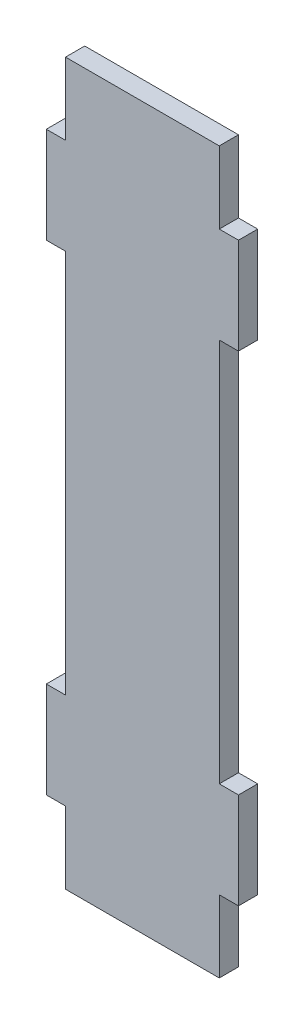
ISO-10303-21;
HEADER;
FILE_DESCRIPTION(('STEP AP214'),'2;1');
FILE_NAME('part.step','',(''),(''),'','','');
FILE_SCHEMA(('AUTOMOTIVE_DESIGN { 1 0 10303 214 1 1 1 1 }'));
ENDSEC;
DATA;
#1=APPLICATION_CONTEXT('core data for automotive mechanical design processes');
#2=APPLICATION_PROTOCOL_DEFINITION('international standard','automotive_design',2000,#1);
#3=PRODUCT_CONTEXT('',#1,'mechanical');
#4=PRODUCT('Part','Part','',(#3));
#5=PRODUCT_RELATED_PRODUCT_CATEGORY('part','',(#4));
#6=PRODUCT_DEFINITION_FORMATION('','',#4);
#7=PRODUCT_DEFINITION_CONTEXT('part definition',#1,'design');
#8=PRODUCT_DEFINITION('design','',#6,#7);
#9=PRODUCT_DEFINITION_SHAPE('','',#8);
#10=(LENGTH_UNIT() NAMED_UNIT(*) SI_UNIT(.MILLI.,.METRE.));
#11=(NAMED_UNIT(*) PLANE_ANGLE_UNIT() SI_UNIT($,.RADIAN.));
#12=(NAMED_UNIT(*) SI_UNIT($,.STERADIAN.) SOLID_ANGLE_UNIT());
#13=UNCERTAINTY_MEASURE_WITH_UNIT(LENGTH_MEASURE(1.E-05),#10,'distance_accuracy_value','');
#14=(GEOMETRIC_REPRESENTATION_CONTEXT(3) GLOBAL_UNCERTAINTY_ASSIGNED_CONTEXT((#13)) GLOBAL_UNIT_ASSIGNED_CONTEXT((#10,
#11,#12)) REPRESENTATION_CONTEXT('',''));
#15=CARTESIAN_POINT('',(0.,0.,0.));
#16=DIRECTION('',(0.,0.,1.));
#17=DIRECTION('',(1.,0.,0.));
#18=AXIS2_PLACEMENT_3D('',#15,#16,#17);
#19=CARTESIAN_POINT('',(-16.,150.,4.));
#20=DIRECTION('',(1.,0.,0.));
#21=DIRECTION('',(0.,1.,0.));
#22=AXIS2_PLACEMENT_3D('',#19,#20,#21);
#23=PLANE('',#22);
#24=DIRECTION('',(0.,-1.,0.));
#25=VECTOR('',#24,1.);
#26=CARTESIAN_POINT('',(-16.,150.,0.));
#27=LINE('',#26,#25);
#28=CARTESIAN_POINT('',(-16.,150.,0.));
#29=VERTEX_POINT('',#28);
#30=CARTESIAN_POINT('',(-16.,135.,0.));
#31=VERTEX_POINT('',#30);
#32=EDGE_CURVE('E201',#29,#31,#27,.T.);
#33=ORIENTED_EDGE('',*,*,#32,.T.);
#34=DIRECTION('',(0.,0.,-1.));
#35=VECTOR('',#34,1.);
#36=CARTESIAN_POINT('',(-16.,135.,4.));
#37=LINE('',#36,#35);
#38=CARTESIAN_POINT('',(-16.,135.,4.));
#39=VERTEX_POINT('',#38);
#40=EDGE_CURVE('E11',#39,#31,#37,.T.);
#41=ORIENTED_EDGE('',*,*,#40,.F.);
#42=DIRECTION('',(0.,-1.,0.));
#43=VECTOR('',#42,1.);
#44=CARTESIAN_POINT('',(-16.,150.,4.));
#45=LINE('',#44,#43);
#46=CARTESIAN_POINT('',(-16.,150.,4.));
#47=VERTEX_POINT('',#46);
#48=EDGE_CURVE('E239',#47,#39,#45,.T.);
#49=ORIENTED_EDGE('',*,*,#48,.F.);
#50=DIRECTION('',(0.,0.,-1.));
#51=VECTOR('',#50,1.);
#52=CARTESIAN_POINT('',(-16.,150.,4.));
#53=LINE('',#52,#51);
#54=EDGE_CURVE('E197',#47,#29,#53,.T.);
#55=ORIENTED_EDGE('',*,*,#54,.T.);
#56=EDGE_LOOP('',(#33,#41,#49,#55));
#57=FACE_BOUND('',#56,.T.);
#58=ADVANCED_FACE('F33',(#57),#23,.F.);
#59=CARTESIAN_POINT('',(-20.,135.,4.));
#60=DIRECTION('',(0.,-1.,0.));
#61=DIRECTION('',(0.,0.,-1.));
#62=AXIS2_PLACEMENT_3D('',#59,#60,#61);
#63=PLANE('',#62);
#64=DIRECTION('',(-1.,0.,0.));
#65=VECTOR('',#64,1.);
#66=CARTESIAN_POINT('',(-20.,135.,0.));
#67=LINE('',#66,#65);
#68=CARTESIAN_POINT('',(-20.,135.,0.));
#69=VERTEX_POINT('',#68);
#70=EDGE_CURVE('E204',#31,#69,#67,.T.);
#71=ORIENTED_EDGE('',*,*,#70,.T.);
#72=DIRECTION('',(0.,0.,-1.));
#73=VECTOR('',#72,1.);
#74=CARTESIAN_POINT('',(-20.,135.,4.));
#75=LINE('',#74,#73);
#76=CARTESIAN_POINT('',(-20.,135.,4.));
#77=VERTEX_POINT('',#76);
#78=EDGE_CURVE('E41',#77,#69,#75,.T.);
#79=ORIENTED_EDGE('',*,*,#78,.F.);
#80=DIRECTION('',(-1.,0.,0.));
#81=VECTOR('',#80,1.);
#82=CARTESIAN_POINT('',(-20.,135.,4.));
#83=LINE('',#82,#81);
#84=EDGE_CURVE('E128',#39,#77,#83,.T.);
#85=ORIENTED_EDGE('',*,*,#84,.F.);
#86=ORIENTED_EDGE('',*,*,#40,.T.);
#87=EDGE_LOOP('',(#71,#79,#85,#86));
#88=FACE_BOUND('',#87,.T.);
#89=ADVANCED_FACE('F357',(#88),#63,.F.);
#90=CARTESIAN_POINT('',(-20.,135.,4.));
#91=DIRECTION('',(1.,0.,0.));
#92=DIRECTION('',(0.,1.,0.));
#93=AXIS2_PLACEMENT_3D('',#90,#91,#92);
#94=PLANE('',#93);
#95=DIRECTION('',(0.,-1.,0.));
#96=VECTOR('',#95,1.);
#97=CARTESIAN_POINT('',(-20.,135.,0.));
#98=LINE('',#97,#96);
#99=CARTESIAN_POINT('',(-20.,115.,0.));
#100=VERTEX_POINT('',#99);
#101=EDGE_CURVE('E206',#69,#100,#98,.T.);
#102=ORIENTED_EDGE('',*,*,#101,.T.);
#103=DIRECTION('',(0.,0.,-1.));
#104=VECTOR('',#103,1.);
#105=CARTESIAN_POINT('',(-20.,115.,4.));
#106=LINE('',#105,#104);
#107=CARTESIAN_POINT('',(-20.,115.,4.));
#108=VERTEX_POINT('',#107);
#109=EDGE_CURVE('E282',#108,#100,#106,.T.);
#110=ORIENTED_EDGE('',*,*,#109,.F.);
#111=DIRECTION('',(0.,-1.,0.));
#112=VECTOR('',#111,1.);
#113=CARTESIAN_POINT('',(-20.,135.,4.));
#114=LINE('',#113,#112);
#115=EDGE_CURVE('E290',#77,#108,#114,.T.);
#116=ORIENTED_EDGE('',*,*,#115,.F.);
#117=ORIENTED_EDGE('',*,*,#78,.T.);
#118=EDGE_LOOP('',(#102,#110,#116,#117));
#119=FACE_BOUND('',#118,.T.);
#120=ADVANCED_FACE('F288',(#119),#94,.F.);
#121=CARTESIAN_POINT('',(-20.,115.,4.));
#122=DIRECTION('',(0.,1.,0.));
#123=DIRECTION('',(0.,0.,1.));
#124=AXIS2_PLACEMENT_3D('',#121,#122,#123);
#125=PLANE('',#124);
#126=DIRECTION('',(1.,0.,0.));
#127=VECTOR('',#126,1.);
#128=CARTESIAN_POINT('',(-20.,115.,0.));
#129=LINE('',#128,#127);
#130=CARTESIAN_POINT('',(-16.,115.,0.));
#131=VERTEX_POINT('',#130);
#132=EDGE_CURVE('E208',#100,#131,#129,.T.);
#133=ORIENTED_EDGE('',*,*,#132,.T.);
#134=DIRECTION('',(0.,0.,-1.));
#135=VECTOR('',#134,1.);
#136=CARTESIAN_POINT('',(-16.,115.,4.));
#137=LINE('',#136,#135);
#138=CARTESIAN_POINT('',(-16.,115.,4.));
#139=VERTEX_POINT('',#138);
#140=EDGE_CURVE('E279',#139,#131,#137,.T.);
#141=ORIENTED_EDGE('',*,*,#140,.F.);
#142=DIRECTION('',(1.,0.,0.));
#143=VECTOR('',#142,1.);
#144=CARTESIAN_POINT('',(-20.,115.,4.));
#145=LINE('',#144,#143);
#146=EDGE_CURVE('E308',#108,#139,#145,.T.);
#147=ORIENTED_EDGE('',*,*,#146,.F.);
#148=ORIENTED_EDGE('',*,*,#109,.T.);
#149=EDGE_LOOP('',(#133,#141,#147,#148));
#150=FACE_BOUND('',#149,.T.);
#151=ADVANCED_FACE('F299',(#150),#125,.F.);
#152=CARTESIAN_POINT('',(-16.,115.,4.));
#153=DIRECTION('',(1.,0.,0.));
#154=DIRECTION('',(0.,1.,0.));
#155=AXIS2_PLACEMENT_3D('',#152,#153,#154);
#156=PLANE('',#155);
#157=DIRECTION('',(0.,-1.,0.));
#158=VECTOR('',#157,1.);
#159=CARTESIAN_POINT('',(-16.,115.,0.));
#160=LINE('',#159,#158);
#161=CARTESIAN_POINT('',(-16.,35.,0.));
#162=VERTEX_POINT('',#161);
#163=EDGE_CURVE('E210',#131,#162,#160,.T.);
#164=ORIENTED_EDGE('',*,*,#163,.T.);
#165=DIRECTION('',(0.,0.,-1.));
#166=VECTOR('',#165,1.);
#167=CARTESIAN_POINT('',(-16.,35.,4.));
#168=LINE('',#167,#166);
#169=CARTESIAN_POINT('',(-16.,35.,4.));
#170=VERTEX_POINT('',#169);
#171=EDGE_CURVE('E276',#170,#162,#168,.T.);
#172=ORIENTED_EDGE('',*,*,#171,.F.);
#173=DIRECTION('',(0.,-1.,0.));
#174=VECTOR('',#173,1.);
#175=CARTESIAN_POINT('',(-16.,115.,4.));
#176=LINE('',#175,#174);
#177=EDGE_CURVE('E305',#139,#170,#176,.T.);
#178=ORIENTED_EDGE('',*,*,#177,.F.);
#179=ORIENTED_EDGE('',*,*,#140,.T.);
#180=EDGE_LOOP('',(#164,#172,#178,#179));
#181=FACE_BOUND('',#180,.T.);
#182=ADVANCED_FACE('F303',(#181),#156,.F.);
#183=CARTESIAN_POINT('',(-20.,35.,4.));
#184=DIRECTION('',(0.,-1.,0.));
#185=DIRECTION('',(0.,0.,-1.));
#186=AXIS2_PLACEMENT_3D('',#183,#184,#185);
#187=PLANE('',#186);
#188=DIRECTION('',(-1.,0.,0.));
#189=VECTOR('',#188,1.);
#190=CARTESIAN_POINT('',(-20.,35.,0.));
#191=LINE('',#190,#189);
#192=CARTESIAN_POINT('',(-20.,35.,0.));
#193=VERTEX_POINT('',#192);
#194=EDGE_CURVE('E212',#162,#193,#191,.T.);
#195=ORIENTED_EDGE('',*,*,#194,.T.);
#196=DIRECTION('',(0.,0.,-1.));
#197=VECTOR('',#196,1.);
#198=CARTESIAN_POINT('',(-20.,35.,4.));
#199=LINE('',#198,#197);
#200=CARTESIAN_POINT('',(-20.,35.,4.));
#201=VERTEX_POINT('',#200);
#202=EDGE_CURVE('E273',#201,#193,#199,.T.);
#203=ORIENTED_EDGE('',*,*,#202,.F.);
#204=DIRECTION('',(-1.,0.,0.));
#205=VECTOR('',#204,1.);
#206=CARTESIAN_POINT('',(-20.,35.,4.));
#207=LINE('',#206,#205);
#208=EDGE_CURVE('E307',#170,#201,#207,.T.);
#209=ORIENTED_EDGE('',*,*,#208,.F.);
#210=ORIENTED_EDGE('',*,*,#171,.T.);
#211=EDGE_LOOP('',(#195,#203,#209,#210));
#212=FACE_BOUND('',#211,.T.);
#213=ADVANCED_FACE('F370',(#212),#187,.F.);
#214=CARTESIAN_POINT('',(-20.,35.,4.));
#215=DIRECTION('',(1.,0.,0.));
#216=DIRECTION('',(0.,1.,0.));
#217=AXIS2_PLACEMENT_3D('',#214,#215,#216);
#218=PLANE('',#217);
#219=DIRECTION('',(0.,-1.,0.));
#220=VECTOR('',#219,1.);
#221=CARTESIAN_POINT('',(-20.,35.,0.));
#222=LINE('',#221,#220);
#223=CARTESIAN_POINT('',(-20.,15.,0.));
#224=VERTEX_POINT('',#223);
#225=EDGE_CURVE('E214',#193,#224,#222,.T.);
#226=ORIENTED_EDGE('',*,*,#225,.T.);
#227=DIRECTION('',(0.,0.,-1.));
#228=VECTOR('',#227,1.);
#229=CARTESIAN_POINT('',(-20.,15.,4.));
#230=LINE('',#229,#228);
#231=CARTESIAN_POINT('',(-20.,15.,4.));
#232=VERTEX_POINT('',#231);
#233=EDGE_CURVE('E270',#232,#224,#230,.T.);
#234=ORIENTED_EDGE('',*,*,#233,.F.);
#235=DIRECTION('',(0.,-1.,0.));
#236=VECTOR('',#235,1.);
#237=CARTESIAN_POINT('',(-20.,35.,4.));
#238=LINE('',#237,#236);
#239=EDGE_CURVE('E310',#201,#232,#238,.T.);
#240=ORIENTED_EDGE('',*,*,#239,.F.);
#241=ORIENTED_EDGE('',*,*,#202,.T.);
#242=EDGE_LOOP('',(#226,#234,#240,#241));
#243=FACE_BOUND('',#242,.T.);
#244=ADVANCED_FACE('F373',(#243),#218,.F.);
#245=CARTESIAN_POINT('',(-20.,15.,4.));
#246=DIRECTION('',(0.,1.,0.));
#247=DIRECTION('',(-1.,0.,0.));
#248=AXIS2_PLACEMENT_3D('',#245,#246,#247);
#249=PLANE('',#248);
#250=DIRECTION('',(1.,0.,0.));
#251=VECTOR('',#250,1.);
#252=CARTESIAN_POINT('',(-20.,15.,0.));
#253=LINE('',#252,#251);
#254=CARTESIAN_POINT('',(-16.,15.,0.));
#255=VERTEX_POINT('',#254);
#256=EDGE_CURVE('E216',#224,#255,#253,.T.);
#257=ORIENTED_EDGE('',*,*,#256,.T.);
#258=DIRECTION('',(0.,0.,-1.));
#259=VECTOR('',#258,1.);
#260=CARTESIAN_POINT('',(-16.,15.,4.));
#261=LINE('',#260,#259);
#262=CARTESIAN_POINT('',(-16.,15.,4.));
#263=VERTEX_POINT('',#262);
#264=EDGE_CURVE('E267',#263,#255,#261,.T.);
#265=ORIENTED_EDGE('',*,*,#264,.F.);
#266=DIRECTION('',(1.,0.,0.));
#267=VECTOR('',#266,1.);
#268=CARTESIAN_POINT('',(-20.,15.,4.));
#269=LINE('',#268,#267);
#270=EDGE_CURVE('E316',#232,#263,#269,.T.);
#271=ORIENTED_EDGE('',*,*,#270,.F.);
#272=ORIENTED_EDGE('',*,*,#233,.T.);
#273=EDGE_LOOP('',(#257,#265,#271,#272));
#274=FACE_BOUND('',#273,.T.);
#275=ADVANCED_FACE('F377',(#274),#249,.F.);
#276=CARTESIAN_POINT('',(-16.,15.,4.));
#277=DIRECTION('',(1.,0.,0.));
#278=DIRECTION('',(0.,1.,0.));
#279=AXIS2_PLACEMENT_3D('',#276,#277,#278);
#280=PLANE('',#279);
#281=DIRECTION('',(0.,-1.,0.));
#282=VECTOR('',#281,1.);
#283=CARTESIAN_POINT('',(-16.,15.,0.));
#284=LINE('',#283,#282);
#285=CARTESIAN_POINT('',(-16.,0.,0.));
#286=VERTEX_POINT('',#285);
#287=EDGE_CURVE('E218',#255,#286,#284,.T.);
#288=ORIENTED_EDGE('',*,*,#287,.T.);
#289=DIRECTION('',(0.,0.,-1.));
#290=VECTOR('',#289,1.);
#291=CARTESIAN_POINT('',(-16.,0.,4.));
#292=LINE('',#291,#290);
#293=CARTESIAN_POINT('',(-16.,0.,4.));
#294=VERTEX_POINT('',#293);
#295=EDGE_CURVE('E264',#294,#286,#292,.T.);
#296=ORIENTED_EDGE('',*,*,#295,.F.);
#297=DIRECTION('',(0.,-1.,0.));
#298=VECTOR('',#297,1.);
#299=CARTESIAN_POINT('',(-16.,15.,4.));
#300=LINE('',#299,#298);
#301=EDGE_CURVE('E318',#263,#294,#300,.T.);
#302=ORIENTED_EDGE('',*,*,#301,.F.);
#303=ORIENTED_EDGE('',*,*,#264,.T.);
#304=EDGE_LOOP('',(#288,#296,#302,#303));
#305=FACE_BOUND('',#304,.T.);
#306=ADVANCED_FACE('F381',(#305),#280,.F.);
#307=CARTESIAN_POINT('',(-16.,0.,4.));
#308=DIRECTION('',(0.,1.,0.));
#309=DIRECTION('',(0.,0.,1.));
#310=AXIS2_PLACEMENT_3D('',#307,#308,#309);
#311=PLANE('',#310);
#312=DIRECTION('',(1.,0.,0.));
#313=VECTOR('',#312,1.);
#314=CARTESIAN_POINT('',(-16.,0.,0.));
#315=LINE('',#314,#313);
#316=CARTESIAN_POINT('',(16.,0.,0.));
#317=VERTEX_POINT('',#316);
#318=EDGE_CURVE('E220',#286,#317,#315,.T.);
#319=ORIENTED_EDGE('',*,*,#318,.T.);
#320=DIRECTION('',(0.,0.,-1.));
#321=VECTOR('',#320,1.);
#322=CARTESIAN_POINT('',(16.,0.,4.));
#323=LINE('',#322,#321);
#324=CARTESIAN_POINT('',(16.,0.,4.));
#325=VERTEX_POINT('',#324);
#326=EDGE_CURVE('E261',#325,#317,#323,.T.);
#327=ORIENTED_EDGE('',*,*,#326,.F.);
#328=DIRECTION('',(1.,0.,0.));
#329=VECTOR('',#328,1.);
#330=CARTESIAN_POINT('',(-16.,0.,4.));
#331=LINE('',#330,#329);
#332=EDGE_CURVE('E320',#294,#325,#331,.T.);
#333=ORIENTED_EDGE('',*,*,#332,.F.);
#334=ORIENTED_EDGE('',*,*,#295,.T.);
#335=EDGE_LOOP('',(#319,#327,#333,#334));
#336=FACE_BOUND('',#335,.T.);
#337=ADVANCED_FACE('F385',(#336),#311,.F.);
#338=CARTESIAN_POINT('',(16.,15.,4.));
#339=DIRECTION('',(-1.,0.,0.));
#340=DIRECTION('',(0.,-1.,0.));
#341=AXIS2_PLACEMENT_3D('',#338,#339,#340);
#342=PLANE('',#341);
#343=DIRECTION('',(0.,1.,0.));
#344=VECTOR('',#343,1.);
#345=CARTESIAN_POINT('',(16.,15.,0.));
#346=LINE('',#345,#344);
#347=CARTESIAN_POINT('',(16.,15.,0.));
#348=VERTEX_POINT('',#347);
#349=EDGE_CURVE('E222',#317,#348,#346,.T.);
#350=ORIENTED_EDGE('',*,*,#349,.T.);
#351=DIRECTION('',(0.,0.,-1.));
#352=VECTOR('',#351,1.);
#353=CARTESIAN_POINT('',(16.,15.,4.));
#354=LINE('',#353,#352);
#355=CARTESIAN_POINT('',(16.,15.,4.));
#356=VERTEX_POINT('',#355);
#357=EDGE_CURVE('E258',#356,#348,#354,.T.);
#358=ORIENTED_EDGE('',*,*,#357,.F.);
#359=DIRECTION('',(0.,1.,0.));
#360=VECTOR('',#359,1.);
#361=CARTESIAN_POINT('',(16.,15.,4.));
#362=LINE('',#361,#360);
#363=EDGE_CURVE('E322',#325,#356,#362,.T.);
#364=ORIENTED_EDGE('',*,*,#363,.F.);
#365=ORIENTED_EDGE('',*,*,#326,.T.);
#366=EDGE_LOOP('',(#350,#358,#364,#365));
#367=FACE_BOUND('',#366,.T.);
#368=ADVANCED_FACE('F389',(#367),#342,.F.);
#369=CARTESIAN_POINT('',(16.,15.,4.));
#370=DIRECTION('',(0.,1.,0.));
#371=DIRECTION('',(-1.,0.,0.));
#372=AXIS2_PLACEMENT_3D('',#369,#370,#371);
#373=PLANE('',#372);
#374=DIRECTION('',(1.,0.,0.));
#375=VECTOR('',#374,1.);
#376=CARTESIAN_POINT('',(16.,15.,0.));
#377=LINE('',#376,#375);
#378=CARTESIAN_POINT('',(20.,15.,0.));
#379=VERTEX_POINT('',#378);
#380=EDGE_CURVE('E224',#348,#379,#377,.T.);
#381=ORIENTED_EDGE('',*,*,#380,.T.);
#382=DIRECTION('',(0.,0.,-1.));
#383=VECTOR('',#382,1.);
#384=CARTESIAN_POINT('',(20.,15.,4.));
#385=LINE('',#384,#383);
#386=CARTESIAN_POINT('',(20.,15.,4.));
#387=VERTEX_POINT('',#386);
#388=EDGE_CURVE('E255',#387,#379,#385,.T.);
#389=ORIENTED_EDGE('',*,*,#388,.F.);
#390=DIRECTION('',(1.,0.,0.));
#391=VECTOR('',#390,1.);
#392=CARTESIAN_POINT('',(16.,15.,4.));
#393=LINE('',#392,#391);
#394=EDGE_CURVE('E324',#356,#387,#393,.T.);
#395=ORIENTED_EDGE('',*,*,#394,.F.);
#396=ORIENTED_EDGE('',*,*,#357,.T.);
#397=EDGE_LOOP('',(#381,#389,#395,#396));
#398=FACE_BOUND('',#397,.T.);
#399=ADVANCED_FACE('F393',(#398),#373,.F.);
#400=CARTESIAN_POINT('',(20.,35.,4.));
#401=DIRECTION('',(-1.,0.,0.));
#402=DIRECTION('',(0.,-1.,0.));
#403=AXIS2_PLACEMENT_3D('',#400,#401,#402);
#404=PLANE('',#403);
#405=DIRECTION('',(0.,1.,0.));
#406=VECTOR('',#405,1.);
#407=CARTESIAN_POINT('',(20.,35.,0.));
#408=LINE('',#407,#406);
#409=CARTESIAN_POINT('',(20.,35.,0.));
#410=VERTEX_POINT('',#409);
#411=EDGE_CURVE('E226',#379,#410,#408,.T.);
#412=ORIENTED_EDGE('',*,*,#411,.T.);
#413=DIRECTION('',(0.,0.,-1.));
#414=VECTOR('',#413,1.);
#415=CARTESIAN_POINT('',(20.,35.,4.));
#416=LINE('',#415,#414);
#417=CARTESIAN_POINT('',(20.,35.,4.));
#418=VERTEX_POINT('',#417);
#419=EDGE_CURVE('E252',#418,#410,#416,.T.);
#420=ORIENTED_EDGE('',*,*,#419,.F.);
#421=DIRECTION('',(0.,1.,0.));
#422=VECTOR('',#421,1.);
#423=CARTESIAN_POINT('',(20.,35.,4.));
#424=LINE('',#423,#422);
#425=EDGE_CURVE('E326',#387,#418,#424,.T.);
#426=ORIENTED_EDGE('',*,*,#425,.F.);
#427=ORIENTED_EDGE('',*,*,#388,.T.);
#428=EDGE_LOOP('',(#412,#420,#426,#427));
#429=FACE_BOUND('',#428,.T.);
#430=ADVANCED_FACE('F397',(#429),#404,.F.);
#431=CARTESIAN_POINT('',(16.,35.,4.));
#432=DIRECTION('',(0.,-1.,0.));
#433=DIRECTION('',(0.,0.,-1.));
#434=AXIS2_PLACEMENT_3D('',#431,#432,#433);
#435=PLANE('',#434);
#436=DIRECTION('',(-1.,0.,0.));
#437=VECTOR('',#436,1.);
#438=CARTESIAN_POINT('',(16.,35.,0.));
#439=LINE('',#438,#437);
#440=CARTESIAN_POINT('',(16.,35.,0.));
#441=VERTEX_POINT('',#440);
#442=EDGE_CURVE('E228',#410,#441,#439,.T.);
#443=ORIENTED_EDGE('',*,*,#442,.T.);
#444=DIRECTION('',(0.,0.,-1.));
#445=VECTOR('',#444,1.);
#446=CARTESIAN_POINT('',(16.,35.,4.));
#447=LINE('',#446,#445);
#448=CARTESIAN_POINT('',(16.,35.,4.));
#449=VERTEX_POINT('',#448);
#450=EDGE_CURVE('E249',#449,#441,#447,.T.);
#451=ORIENTED_EDGE('',*,*,#450,.F.);
#452=DIRECTION('',(-1.,0.,0.));
#453=VECTOR('',#452,1.);
#454=CARTESIAN_POINT('',(16.,35.,4.));
#455=LINE('',#454,#453);
#456=EDGE_CURVE('E328',#418,#449,#455,.T.);
#457=ORIENTED_EDGE('',*,*,#456,.F.);
#458=ORIENTED_EDGE('',*,*,#419,.T.);
#459=EDGE_LOOP('',(#443,#451,#457,#458));
#460=FACE_BOUND('',#459,.T.);
#461=ADVANCED_FACE('F401',(#460),#435,.F.);
#462=CARTESIAN_POINT('',(16.,115.,4.));
#463=DIRECTION('',(-1.,0.,0.));
#464=DIRECTION('',(0.,-1.,0.));
#465=AXIS2_PLACEMENT_3D('',#462,#463,#464);
#466=PLANE('',#465);
#467=DIRECTION('',(0.,1.,0.));
#468=VECTOR('',#467,1.);
#469=CARTESIAN_POINT('',(16.,115.,0.));
#470=LINE('',#469,#468);
#471=CARTESIAN_POINT('',(16.,115.,0.));
#472=VERTEX_POINT('',#471);
#473=EDGE_CURVE('E230',#441,#472,#470,.T.);
#474=ORIENTED_EDGE('',*,*,#473,.T.);
#475=DIRECTION('',(0.,0.,-1.));
#476=VECTOR('',#475,1.);
#477=CARTESIAN_POINT('',(16.,115.,4.));
#478=LINE('',#477,#476);
#479=CARTESIAN_POINT('',(16.,115.,4.));
#480=VERTEX_POINT('',#479);
#481=EDGE_CURVE('E246',#480,#472,#478,.T.);
#482=ORIENTED_EDGE('',*,*,#481,.F.);
#483=DIRECTION('',(0.,1.,0.));
#484=VECTOR('',#483,1.);
#485=CARTESIAN_POINT('',(16.,115.,4.));
#486=LINE('',#485,#484);
#487=EDGE_CURVE('E330',#449,#480,#486,.T.);
#488=ORIENTED_EDGE('',*,*,#487,.F.);
#489=ORIENTED_EDGE('',*,*,#450,.T.);
#490=EDGE_LOOP('',(#474,#482,#488,#489));
#491=FACE_BOUND('',#490,.T.);
#492=ADVANCED_FACE('F405',(#491),#466,.F.);
#493=CARTESIAN_POINT('',(16.,115.,4.));
#494=DIRECTION('',(0.,1.,0.));
#495=DIRECTION('',(0.,0.,1.));
#496=AXIS2_PLACEMENT_3D('',#493,#494,#495);
#497=PLANE('',#496);
#498=DIRECTION('',(1.,0.,0.));
#499=VECTOR('',#498,1.);
#500=CARTESIAN_POINT('',(16.,115.,0.));
#501=LINE('',#500,#499);
#502=CARTESIAN_POINT('',(20.,115.,0.));
#503=VERTEX_POINT('',#502);
#504=EDGE_CURVE('E232',#472,#503,#501,.T.);
#505=ORIENTED_EDGE('',*,*,#504,.T.);
#506=DIRECTION('',(0.,0.,-1.));
#507=VECTOR('',#506,1.);
#508=CARTESIAN_POINT('',(20.,115.,4.));
#509=LINE('',#508,#507);
#510=CARTESIAN_POINT('',(20.,115.,4.));
#511=VERTEX_POINT('',#510);
#512=EDGE_CURVE('E243',#511,#503,#509,.T.);
#513=ORIENTED_EDGE('',*,*,#512,.F.);
#514=DIRECTION('',(1.,0.,0.));
#515=VECTOR('',#514,1.);
#516=CARTESIAN_POINT('',(16.,115.,4.));
#517=LINE('',#516,#515);
#518=EDGE_CURVE('E332',#480,#511,#517,.T.);
#519=ORIENTED_EDGE('',*,*,#518,.F.);
#520=ORIENTED_EDGE('',*,*,#481,.T.);
#521=EDGE_LOOP('',(#505,#513,#519,#520));
#522=FACE_BOUND('',#521,.T.);
#523=ADVANCED_FACE('F338',(#522),#497,.F.);
#524=CARTESIAN_POINT('',(20.,135.,4.));
#525=DIRECTION('',(-1.,0.,0.));
#526=DIRECTION('',(0.,-1.,0.));
#527=AXIS2_PLACEMENT_3D('',#524,#525,#526);
#528=PLANE('',#527);
#529=DIRECTION('',(0.,1.,0.));
#530=VECTOR('',#529,1.);
#531=CARTESIAN_POINT('',(20.,135.,0.));
#532=LINE('',#531,#530);
#533=CARTESIAN_POINT('',(20.,135.,0.));
#534=VERTEX_POINT('',#533);
#535=EDGE_CURVE('E234',#503,#534,#532,.T.);
#536=ORIENTED_EDGE('',*,*,#535,.T.);
#537=DIRECTION('',(0.,0.,-1.));
#538=VECTOR('',#537,1.);
#539=CARTESIAN_POINT('',(20.,135.,4.));
#540=LINE('',#539,#538);
#541=CARTESIAN_POINT('',(20.,135.,4.));
#542=VERTEX_POINT('',#541);
#543=EDGE_CURVE('E192',#542,#534,#540,.T.);
#544=ORIENTED_EDGE('',*,*,#543,.F.);
#545=DIRECTION('',(0.,1.,0.));
#546=VECTOR('',#545,1.);
#547=CARTESIAN_POINT('',(20.,135.,4.));
#548=LINE('',#547,#546);
#549=EDGE_CURVE('E183',#511,#542,#548,.T.);
#550=ORIENTED_EDGE('',*,*,#549,.F.);
#551=ORIENTED_EDGE('',*,*,#512,.T.);
#552=EDGE_LOOP('',(#536,#544,#550,#551));
#553=FACE_BOUND('',#552,.T.);
#554=ADVANCED_FACE('F342',(#553),#528,.F.);
#555=CARTESIAN_POINT('',(16.,135.,4.));
#556=DIRECTION('',(0.,-1.,0.));
#557=DIRECTION('',(0.,0.,-1.));
#558=AXIS2_PLACEMENT_3D('',#555,#556,#557);
#559=PLANE('',#558);
#560=DIRECTION('',(-1.,0.,0.));
#561=VECTOR('',#560,1.);
#562=CARTESIAN_POINT('',(16.,135.,0.));
#563=LINE('',#562,#561);
#564=CARTESIAN_POINT('',(16.,135.,0.));
#565=VERTEX_POINT('',#564);
#566=EDGE_CURVE('E191',#534,#565,#563,.T.);
#567=ORIENTED_EDGE('',*,*,#566,.T.);
#568=DIRECTION('',(0.,0.,-1.));
#569=VECTOR('',#568,1.);
#570=CARTESIAN_POINT('',(16.,135.,4.));
#571=LINE('',#570,#569);
#572=CARTESIAN_POINT('',(16.,135.,4.));
#573=VERTEX_POINT('',#572);
#574=EDGE_CURVE('E188',#573,#565,#571,.T.);
#575=ORIENTED_EDGE('',*,*,#574,.F.);
#576=DIRECTION('',(-1.,0.,0.));
#577=VECTOR('',#576,1.);
#578=CARTESIAN_POINT('',(16.,135.,4.));
#579=LINE('',#578,#577);
#580=EDGE_CURVE('E177',#542,#573,#579,.T.);
#581=ORIENTED_EDGE('',*,*,#580,.F.);
#582=ORIENTED_EDGE('',*,*,#543,.T.);
#583=EDGE_LOOP('',(#567,#575,#581,#582));
#584=FACE_BOUND('',#583,.T.);
#585=ADVANCED_FACE('F189',(#584),#559,.F.);
#586=CARTESIAN_POINT('',(16.,150.,4.));
#587=DIRECTION('',(-1.,0.,0.));
#588=DIRECTION('',(0.,-1.,0.));
#589=AXIS2_PLACEMENT_3D('',#586,#587,#588);
#590=PLANE('',#589);
#591=DIRECTION('',(0.,1.,0.));
#592=VECTOR('',#591,1.);
#593=CARTESIAN_POINT('',(16.,150.,0.));
#594=LINE('',#593,#592);
#595=CARTESIAN_POINT('',(16.,150.,0.));
#596=VERTEX_POINT('',#595);
#597=EDGE_CURVE('E114',#565,#596,#594,.T.);
#598=ORIENTED_EDGE('',*,*,#597,.T.);
#599=DIRECTION('',(0.,0.,-1.));
#600=VECTOR('',#599,1.);
#601=CARTESIAN_POINT('',(16.,150.,4.));
#602=LINE('',#601,#600);
#603=CARTESIAN_POINT('',(16.,150.,4.));
#604=VERTEX_POINT('',#603);
#605=EDGE_CURVE('E193',#604,#596,#602,.T.);
#606=ORIENTED_EDGE('',*,*,#605,.F.);
#607=DIRECTION('',(0.,1.,0.));
#608=VECTOR('',#607,1.);
#609=CARTESIAN_POINT('',(16.,150.,4.));
#610=LINE('',#609,#608);
#611=EDGE_CURVE('E181',#573,#604,#610,.T.);
#612=ORIENTED_EDGE('',*,*,#611,.F.);
#613=ORIENTED_EDGE('',*,*,#574,.T.);
#614=EDGE_LOOP('',(#598,#606,#612,#613));
#615=FACE_BOUND('',#614,.T.);
#616=ADVANCED_FACE('F195',(#615),#590,.F.);
#617=CARTESIAN_POINT('',(-16.,150.,4.));
#618=DIRECTION('',(0.,-1.,0.));
#619=DIRECTION('',(0.,0.,-1.));
#620=AXIS2_PLACEMENT_3D('',#617,#618,#619);
#621=PLANE('',#620);
#622=DIRECTION('',(-1.,0.,0.));
#623=VECTOR('',#622,1.);
#624=CARTESIAN_POINT('',(-16.,150.,0.));
#625=LINE('',#624,#623);
#626=EDGE_CURVE('E120',#596,#29,#625,.T.);
#627=ORIENTED_EDGE('',*,*,#626,.T.);
#628=ORIENTED_EDGE('',*,*,#54,.F.);
#629=DIRECTION('',(-1.,0.,0.));
#630=VECTOR('',#629,1.);
#631=CARTESIAN_POINT('',(-16.,150.,4.));
#632=LINE('',#631,#630);
#633=EDGE_CURVE('E49',#604,#47,#632,.T.);
#634=ORIENTED_EDGE('',*,*,#633,.F.);
#635=ORIENTED_EDGE('',*,*,#605,.T.);
#636=EDGE_LOOP('',(#627,#628,#634,#635));
#637=FACE_BOUND('',#636,.T.);
#638=ADVANCED_FACE('F346',(#637),#621,.F.);
#639=CARTESIAN_POINT('',(-16.,135.,4.));
#640=DIRECTION('',(0.,0.,1.));
#641=DIRECTION('',(1.,0.,0.));
#642=AXIS2_PLACEMENT_3D('',#639,#640,#641);
#643=PLANE('',#642);
#644=ORIENTED_EDGE('',*,*,#48,.T.);
#645=ORIENTED_EDGE('',*,*,#84,.T.);
#646=ORIENTED_EDGE('',*,*,#115,.T.);
#647=ORIENTED_EDGE('',*,*,#146,.T.);
#648=ORIENTED_EDGE('',*,*,#177,.T.);
#649=ORIENTED_EDGE('',*,*,#208,.T.);
#650=ORIENTED_EDGE('',*,*,#239,.T.);
#651=ORIENTED_EDGE('',*,*,#270,.T.);
#652=ORIENTED_EDGE('',*,*,#301,.T.);
#653=ORIENTED_EDGE('',*,*,#332,.T.);
#654=ORIENTED_EDGE('',*,*,#363,.T.);
#655=ORIENTED_EDGE('',*,*,#394,.T.);
#656=ORIENTED_EDGE('',*,*,#425,.T.);
#657=ORIENTED_EDGE('',*,*,#456,.T.);
#658=ORIENTED_EDGE('',*,*,#487,.T.);
#659=ORIENTED_EDGE('',*,*,#518,.T.);
#660=ORIENTED_EDGE('',*,*,#549,.T.);
#661=ORIENTED_EDGE('',*,*,#580,.T.);
#662=ORIENTED_EDGE('',*,*,#611,.T.);
#663=ORIENTED_EDGE('',*,*,#633,.T.);
#664=EDGE_LOOP('',(#644,#645,#646,#647,#648,#649,#650,#651,#652,#653,#654,#655,#656,#657,#658,
#659,#660,#661,#662,#663));
#665=FACE_BOUND('',#664,.T.);
#666=ADVANCED_FACE('F179',(#665),#643,.T.);
#667=CARTESIAN_POINT('',(-16.,135.,0.));
#668=DIRECTION('',(0.,0.,1.));
#669=DIRECTION('',(1.,0.,0.));
#670=AXIS2_PLACEMENT_3D('',#667,#668,#669);
#671=PLANE('',#670);
#672=ORIENTED_EDGE('',*,*,#32,.F.);
#673=ORIENTED_EDGE('',*,*,#626,.F.);
#674=ORIENTED_EDGE('',*,*,#597,.F.);
#675=ORIENTED_EDGE('',*,*,#566,.F.);
#676=ORIENTED_EDGE('',*,*,#535,.F.);
#677=ORIENTED_EDGE('',*,*,#504,.F.);
#678=ORIENTED_EDGE('',*,*,#473,.F.);
#679=ORIENTED_EDGE('',*,*,#442,.F.);
#680=ORIENTED_EDGE('',*,*,#411,.F.);
#681=ORIENTED_EDGE('',*,*,#380,.F.);
#682=ORIENTED_EDGE('',*,*,#349,.F.);
#683=ORIENTED_EDGE('',*,*,#318,.F.);
#684=ORIENTED_EDGE('',*,*,#287,.F.);
#685=ORIENTED_EDGE('',*,*,#256,.F.);
#686=ORIENTED_EDGE('',*,*,#225,.F.);
#687=ORIENTED_EDGE('',*,*,#194,.F.);
#688=ORIENTED_EDGE('',*,*,#163,.F.);
#689=ORIENTED_EDGE('',*,*,#132,.F.);
#690=ORIENTED_EDGE('',*,*,#101,.F.);
#691=ORIENTED_EDGE('',*,*,#70,.F.);
#692=EDGE_LOOP('',(#672,#673,#674,#675,#676,#677,#678,#679,#680,#681,#682,#683,#684,#685,#686,
#687,#688,#689,#690,#691));
#693=FACE_BOUND('',#692,.T.);
#694=ADVANCED_FACE('F294',(#693),#671,.F.);
#695=CLOSED_SHELL('',(#58,#89,#120,#151,#182,#213,#244,#275,#306,#337,#368,#399,#430,#461,#492,
#523,#554,#585,#616,#638,#666,#694));
#696=MANIFOLD_SOLID_BREP('B2',#695);
#697=ADVANCED_BREP_SHAPE_REPRESENTATION('',(#18,#696),#14);
#698=SHAPE_DEFINITION_REPRESENTATION(#9,#697);
ENDSEC;
END-ISO-10303-21;
